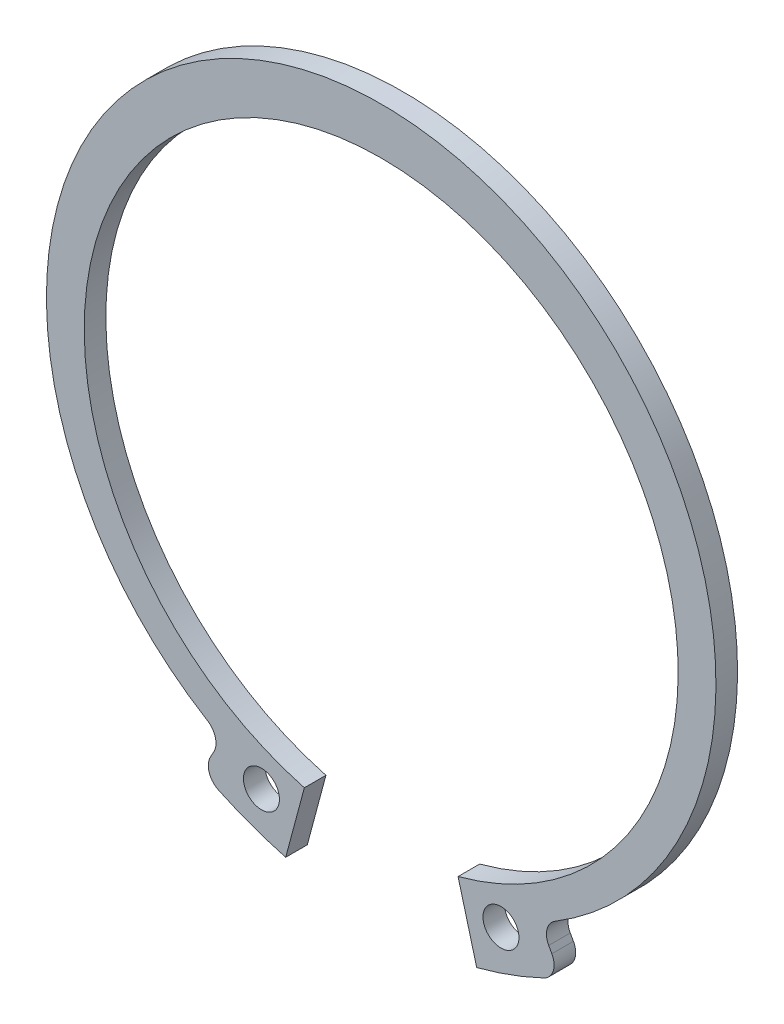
ISO-10303-21;
HEADER;
FILE_DESCRIPTION(('STEP AP214'),'2;1');
FILE_NAME('part.step','',(''),(''),'','','');
FILE_SCHEMA(('AUTOMOTIVE_DESIGN { 1 0 10303 214 1 1 1 1 }'));
ENDSEC;
DATA;
#1=APPLICATION_CONTEXT('core data for automotive mechanical design processes');
#2=APPLICATION_PROTOCOL_DEFINITION('international standard','automotive_design',2000,#1);
#3=PRODUCT_CONTEXT('',#1,'mechanical');
#4=PRODUCT('Part','Part','',(#3));
#5=PRODUCT_RELATED_PRODUCT_CATEGORY('part','',(#4));
#6=PRODUCT_DEFINITION_FORMATION('','',#4);
#7=PRODUCT_DEFINITION_CONTEXT('part definition',#1,'design');
#8=PRODUCT_DEFINITION('design','',#6,#7);
#9=PRODUCT_DEFINITION_SHAPE('','',#8);
#10=(LENGTH_UNIT() NAMED_UNIT(*) SI_UNIT(.MILLI.,.METRE.));
#11=(NAMED_UNIT(*) PLANE_ANGLE_UNIT() SI_UNIT($,.RADIAN.));
#12=(NAMED_UNIT(*) SI_UNIT($,.STERADIAN.) SOLID_ANGLE_UNIT());
#13=UNCERTAINTY_MEASURE_WITH_UNIT(LENGTH_MEASURE(1.E-05),#10,'distance_accuracy_value','');
#14=(GEOMETRIC_REPRESENTATION_CONTEXT(3) GLOBAL_UNCERTAINTY_ASSIGNED_CONTEXT((#13)) GLOBAL_UNIT_ASSIGNED_CONTEXT((#10,
#11,#12)) REPRESENTATION_CONTEXT('',''));
#15=CARTESIAN_POINT('',(0.,0.,0.));
#16=DIRECTION('',(0.,0.,1.));
#17=DIRECTION('',(1.,0.,0.));
#18=AXIS2_PLACEMENT_3D('',#15,#16,#17);
#19=CARTESIAN_POINT('',(-10.1795082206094,-16.2492570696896,1.2));
#20=DIRECTION('',(0.,0.,-1.));
#21=DIRECTION('',(-1.,0.,0.));
#22=AXIS2_PLACEMENT_3D('',#19,#20,#21);
#23=PLANE('',#22);
#24=CARTESIAN_POINT('',(6.6536710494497,-17.1877478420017,1.2));
#25=DIRECTION('',(0.,0.,1.));
#26=DIRECTION('',(1.,0.,0.));
#27=AXIS2_PLACEMENT_3D('',#24,#25,#26);
#28=CIRCLE('',#27,1.);
#29=CARTESIAN_POINT('',(7.6536710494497,-17.1877478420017,1.2));
#30=VERTEX_POINT('',#29);
#31=EDGE_CURVE('E137',#30,#30,#28,.T.);
#32=ORIENTED_EDGE('',*,*,#31,.F.);
#33=EDGE_LOOP('',(#32));
#34=FACE_BOUND('',#33,.T.);
#35=CARTESIAN_POINT('',(-10.1795082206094,-16.2492570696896,1.2));
#36=DIRECTION('',(0.,0.,-1.));
#37=DIRECTION('',(-1.,0.,0.));
#38=AXIS2_PLACEMENT_3D('',#35,#36,#37);
#39=CIRCLE('',#38,1.);
#40=CARTESIAN_POINT('',(-9.66014555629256,-15.3947031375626,1.2));
#41=VERTEX_POINT('',#40);
#42=CARTESIAN_POINT('',(-9.3055324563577,-16.7352265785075,1.2));
#43=VERTEX_POINT('',#42);
#44=EDGE_CURVE('E163',#41,#43,#39,.T.);
#45=ORIENTED_EDGE('',*,*,#44,.T.);
#46=DIRECTION('',(-0.485969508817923,-0.873975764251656,0.));
#47=VECTOR('',#46,1.);
#48=CARTESIAN_POINT('',(-9.3055324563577,-16.7352265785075,1.2));
#49=LINE('',#48,#47);
#50=CARTESIAN_POINT('',(-9.48013727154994,-17.0492388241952,1.2));
#51=VERTEX_POINT('',#50);
#52=EDGE_CURVE('E132',#43,#51,#49,.T.);
#53=ORIENTED_EDGE('',*,*,#52,.T.);
#54=CARTESIAN_POINT('',(-8.60616150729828,-17.5352083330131,1.2));
#55=DIRECTION('',(0.,0.,1.));
#56=DIRECTION('',(-1.,0.,0.));
#57=AXIS2_PLACEMENT_3D('',#54,#55,#56);
#58=CIRCLE('',#57,0.999999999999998);
#59=CARTESIAN_POINT('',(-9.03682785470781,-18.4377195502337,1.2));
#60=VERTEX_POINT('',#59);
#61=EDGE_CURVE('E166',#51,#60,#58,.T.);
#62=ORIENTED_EDGE('',*,*,#61,.T.);
#63=CARTESIAN_POINT('',(0.,0.5,1.2));
#64=DIRECTION('',(0.,0.,1.));
#65=DIRECTION('',(1.,0.,0.));
#66=AXIS2_PLACEMENT_3D('',#63,#64,#65);
#67=CIRCLE('',#66,20.9833619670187);
#68=CARTESIAN_POINT('',(-5.30579042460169,-19.8014794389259,1.2));
#69=VERTEX_POINT('',#68);
#70=EDGE_CURVE('E168',#60,#69,#67,.T.);
#71=ORIENTED_EDGE('',*,*,#70,.T.);
#72=DIRECTION('',(0.258819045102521,0.965925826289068,0.));
#73=VECTOR('',#72,1.);
#74=CARTESIAN_POINT('',(-4.2705142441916,-15.9377761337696,1.2));
#75=LINE('',#74,#73);
#76=CARTESIAN_POINT('',(-4.27051424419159,-15.9377761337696,1.2));
#77=VERTEX_POINT('',#76);
#78=EDGE_CURVE('E170',#69,#77,#75,.T.);
#79=ORIENTED_EDGE('',*,*,#78,.T.);
#80=CARTESIAN_POINT('',(0.,0.,1.2));
#81=DIRECTION('',(0.,0.,-1.));
#82=DIRECTION('',(1.,0.,0.));
#83=AXIS2_PLACEMENT_3D('',#80,#81,#82);
#84=CIRCLE('',#83,16.5);
#85=CARTESIAN_POINT('',(4.2705142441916,-15.9377761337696,1.2));
#86=VERTEX_POINT('',#85);
#87=EDGE_CURVE('E172',#77,#86,#84,.T.);
#88=ORIENTED_EDGE('',*,*,#87,.T.);
#89=DIRECTION('',(0.258819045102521,-0.965925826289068,0.));
#90=VECTOR('',#89,1.);
#91=CARTESIAN_POINT('',(4.2705142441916,-15.9377761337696,1.2));
#92=LINE('',#91,#90);
#93=CARTESIAN_POINT('',(5.30579042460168,-19.8014794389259,1.2));
#94=VERTEX_POINT('',#93);
#95=EDGE_CURVE('E174',#86,#94,#92,.T.);
#96=ORIENTED_EDGE('',*,*,#95,.T.);
#97=CARTESIAN_POINT('',(0.,0.5,1.2));
#98=DIRECTION('',(0.,0.,1.));
#99=DIRECTION('',(1.,0.,0.));
#100=AXIS2_PLACEMENT_3D('',#97,#98,#99);
#101=CIRCLE('',#100,20.9833619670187);
#102=CARTESIAN_POINT('',(9.0368278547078,-18.4377195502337,1.2));
#103=VERTEX_POINT('',#102);
#104=EDGE_CURVE('E176',#94,#103,#101,.T.);
#105=ORIENTED_EDGE('',*,*,#104,.T.);
#106=CARTESIAN_POINT('',(8.60616150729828,-17.5352083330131,1.2));
#107=DIRECTION('',(0.,0.,1.));
#108=DIRECTION('',(1.,0.,0.));
#109=AXIS2_PLACEMENT_3D('',#106,#107,#108);
#110=CIRCLE('',#109,0.999999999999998);
#111=CARTESIAN_POINT('',(9.48013727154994,-17.0492388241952,1.2));
#112=VERTEX_POINT('',#111);
#113=EDGE_CURVE('E178',#103,#112,#110,.T.);
#114=ORIENTED_EDGE('',*,*,#113,.T.);
#115=DIRECTION('',(-0.485969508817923,0.873975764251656,0.));
#116=VECTOR('',#115,1.);
#117=CARTESIAN_POINT('',(9.3055324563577,-16.7352265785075,1.2));
#118=LINE('',#117,#116);
#119=CARTESIAN_POINT('',(9.30553245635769,-16.7352265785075,1.2));
#120=VERTEX_POINT('',#119);
#121=EDGE_CURVE('E180',#112,#120,#118,.T.);
#122=ORIENTED_EDGE('',*,*,#121,.T.);
#123=CARTESIAN_POINT('',(10.1795082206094,-16.2492570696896,1.2));
#124=DIRECTION('',(0.,0.,-1.));
#125=DIRECTION('',(1.,0.,0.));
#126=AXIS2_PLACEMENT_3D('',#123,#124,#125);
#127=CIRCLE('',#126,1.);
#128=CARTESIAN_POINT('',(9.66014555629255,-15.3947031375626,1.2));
#129=VERTEX_POINT('',#128);
#130=EDGE_CURVE('E49',#120,#129,#127,.T.);
#131=ORIENTED_EDGE('',*,*,#130,.T.);
#132=CARTESIAN_POINT('',(0.,0.5,1.2));
#133=DIRECTION('',(0.,0.,1.));
#134=DIRECTION('',(1.,0.,0.));
#135=AXIS2_PLACEMENT_3D('',#132,#133,#134);
#136=CIRCLE('',#135,18.6);
#137=EDGE_CURVE('E44',#129,#41,#136,.T.);
#138=ORIENTED_EDGE('',*,*,#137,.T.);
#139=EDGE_LOOP('',(#45,#53,#62,#71,#79,#88,#96,#105,#114,#122,#131,#138));
#140=FACE_BOUND('',#139,.T.);
#141=CARTESIAN_POINT('',(-6.6536710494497,-17.1877478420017,1.2));
#142=DIRECTION('',(0.,0.,1.));
#143=DIRECTION('',(-1.,0.,0.));
#144=AXIS2_PLACEMENT_3D('',#141,#142,#143);
#145=CIRCLE('',#144,1.);
#146=CARTESIAN_POINT('',(-7.6536710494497,-17.1877478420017,1.2));
#147=VERTEX_POINT('',#146);
#148=EDGE_CURVE('E283',#147,#147,#145,.T.);
#149=ORIENTED_EDGE('',*,*,#148,.F.);
#150=EDGE_LOOP('',(#149));
#151=FACE_BOUND('',#150,.T.);
#152=ADVANCED_FACE('F29',(#34,#140,#151),#23,.F.);
#153=CARTESIAN_POINT('',(-10.1795082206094,-16.2492570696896,0.));
#154=DIRECTION('',(0.,0.,-1.));
#155=DIRECTION('',(-1.,0.,0.));
#156=AXIS2_PLACEMENT_3D('',#153,#154,#155);
#157=PLANE('',#156);
#158=CARTESIAN_POINT('',(6.6536710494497,-17.1877478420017,0.));
#159=DIRECTION('',(0.,0.,1.));
#160=DIRECTION('',(1.,0.,0.));
#161=AXIS2_PLACEMENT_3D('',#158,#159,#160);
#162=CIRCLE('',#161,1.);
#163=CARTESIAN_POINT('',(7.6536710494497,-17.1877478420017,0.));
#164=VERTEX_POINT('',#163);
#165=EDGE_CURVE('E140',#164,#164,#162,.T.);
#166=ORIENTED_EDGE('',*,*,#165,.T.);
#167=EDGE_LOOP('',(#166));
#168=FACE_BOUND('',#167,.T.);
#169=CARTESIAN_POINT('',(-10.1795082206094,-16.2492570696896,0.));
#170=DIRECTION('',(0.,0.,-1.));
#171=DIRECTION('',(-1.,0.,0.));
#172=AXIS2_PLACEMENT_3D('',#169,#170,#171);
#173=CIRCLE('',#172,1.);
#174=CARTESIAN_POINT('',(-9.66014555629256,-15.3947031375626,0.));
#175=VERTEX_POINT('',#174);
#176=CARTESIAN_POINT('',(-9.3055324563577,-16.7352265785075,0.));
#177=VERTEX_POINT('',#176);
#178=EDGE_CURVE('E123',#175,#177,#173,.T.);
#179=ORIENTED_EDGE('',*,*,#178,.F.);
#180=CARTESIAN_POINT('',(0.,0.5,0.));
#181=DIRECTION('',(0.,0.,1.));
#182=DIRECTION('',(1.,0.,0.));
#183=AXIS2_PLACEMENT_3D('',#180,#181,#182);
#184=CIRCLE('',#183,18.6);
#185=CARTESIAN_POINT('',(9.66014555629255,-15.3947031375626,0.));
#186=VERTEX_POINT('',#185);
#187=EDGE_CURVE('E161',#186,#175,#184,.T.);
#188=ORIENTED_EDGE('',*,*,#187,.F.);
#189=CARTESIAN_POINT('',(10.1795082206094,-16.2492570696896,0.));
#190=DIRECTION('',(0.,0.,-1.));
#191=DIRECTION('',(1.,0.,0.));
#192=AXIS2_PLACEMENT_3D('',#189,#190,#191);
#193=CIRCLE('',#192,1.);
#194=CARTESIAN_POINT('',(9.30553245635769,-16.7352265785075,0.));
#195=VERTEX_POINT('',#194);
#196=EDGE_CURVE('E159',#195,#186,#193,.T.);
#197=ORIENTED_EDGE('',*,*,#196,.F.);
#198=DIRECTION('',(-0.485969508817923,0.873975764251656,0.));
#199=VECTOR('',#198,1.);
#200=CARTESIAN_POINT('',(9.3055324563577,-16.7352265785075,0.));
#201=LINE('',#200,#199);
#202=CARTESIAN_POINT('',(9.48013727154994,-17.0492388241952,0.));
#203=VERTEX_POINT('',#202);
#204=EDGE_CURVE('E157',#203,#195,#201,.T.);
#205=ORIENTED_EDGE('',*,*,#204,.F.);
#206=CARTESIAN_POINT('',(8.60616150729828,-17.5352083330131,0.));
#207=DIRECTION('',(0.,0.,1.));
#208=DIRECTION('',(1.,0.,0.));
#209=AXIS2_PLACEMENT_3D('',#206,#207,#208);
#210=CIRCLE('',#209,0.999999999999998);
#211=CARTESIAN_POINT('',(9.0368278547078,-18.4377195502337,0.));
#212=VERTEX_POINT('',#211);
#213=EDGE_CURVE('E155',#212,#203,#210,.T.);
#214=ORIENTED_EDGE('',*,*,#213,.F.);
#215=CARTESIAN_POINT('',(0.,0.5,0.));
#216=DIRECTION('',(0.,0.,1.));
#217=DIRECTION('',(1.,0.,0.));
#218=AXIS2_PLACEMENT_3D('',#215,#216,#217);
#219=CIRCLE('',#218,20.9833619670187);
#220=CARTESIAN_POINT('',(5.30579042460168,-19.8014794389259,0.));
#221=VERTEX_POINT('',#220);
#222=EDGE_CURVE('E153',#221,#212,#219,.T.);
#223=ORIENTED_EDGE('',*,*,#222,.F.);
#224=DIRECTION('',(0.258819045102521,-0.965925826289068,0.));
#225=VECTOR('',#224,1.);
#226=CARTESIAN_POINT('',(4.2705142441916,-15.9377761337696,0.));
#227=LINE('',#226,#225);
#228=CARTESIAN_POINT('',(4.2705142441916,-15.9377761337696,0.));
#229=VERTEX_POINT('',#228);
#230=EDGE_CURVE('E151',#229,#221,#227,.T.);
#231=ORIENTED_EDGE('',*,*,#230,.F.);
#232=CARTESIAN_POINT('',(0.,0.,0.));
#233=DIRECTION('',(0.,0.,-1.));
#234=DIRECTION('',(1.,0.,0.));
#235=AXIS2_PLACEMENT_3D('',#232,#233,#234);
#236=CIRCLE('',#235,16.5);
#237=CARTESIAN_POINT('',(-4.27051424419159,-15.9377761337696,0.));
#238=VERTEX_POINT('',#237);
#239=EDGE_CURVE('E149',#238,#229,#236,.T.);
#240=ORIENTED_EDGE('',*,*,#239,.F.);
#241=DIRECTION('',(0.258819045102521,0.965925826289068,0.));
#242=VECTOR('',#241,1.);
#243=CARTESIAN_POINT('',(-4.2705142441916,-15.9377761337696,0.));
#244=LINE('',#243,#242);
#245=CARTESIAN_POINT('',(-5.30579042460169,-19.8014794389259,0.));
#246=VERTEX_POINT('',#245);
#247=EDGE_CURVE('E147',#246,#238,#244,.T.);
#248=ORIENTED_EDGE('',*,*,#247,.F.);
#249=CARTESIAN_POINT('',(0.,0.5,0.));
#250=DIRECTION('',(0.,0.,1.));
#251=DIRECTION('',(1.,0.,0.));
#252=AXIS2_PLACEMENT_3D('',#249,#250,#251);
#253=CIRCLE('',#252,20.9833619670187);
#254=CARTESIAN_POINT('',(-9.03682785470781,-18.4377195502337,0.));
#255=VERTEX_POINT('',#254);
#256=EDGE_CURVE('E145',#255,#246,#253,.T.);
#257=ORIENTED_EDGE('',*,*,#256,.F.);
#258=CARTESIAN_POINT('',(-8.60616150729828,-17.5352083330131,0.));
#259=DIRECTION('',(0.,0.,1.));
#260=DIRECTION('',(-1.,0.,0.));
#261=AXIS2_PLACEMENT_3D('',#258,#259,#260);
#262=CIRCLE('',#261,0.999999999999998);
#263=CARTESIAN_POINT('',(-9.48013727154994,-17.0492388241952,0.));
#264=VERTEX_POINT('',#263);
#265=EDGE_CURVE('E125',#264,#255,#262,.T.);
#266=ORIENTED_EDGE('',*,*,#265,.F.);
#267=DIRECTION('',(-0.485969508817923,-0.873975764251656,0.));
#268=VECTOR('',#267,1.);
#269=CARTESIAN_POINT('',(-9.3055324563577,-16.7352265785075,0.));
#270=LINE('',#269,#268);
#271=EDGE_CURVE('E118',#177,#264,#270,.T.);
#272=ORIENTED_EDGE('',*,*,#271,.F.);
#273=EDGE_LOOP('',(#179,#188,#197,#205,#214,#223,#231,#240,#248,#257,#266,#272));
#274=FACE_BOUND('',#273,.T.);
#275=CARTESIAN_POINT('',(-6.6536710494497,-17.1877478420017,0.));
#276=DIRECTION('',(0.,0.,1.));
#277=DIRECTION('',(-1.,0.,0.));
#278=AXIS2_PLACEMENT_3D('',#275,#276,#277);
#279=CIRCLE('',#278,1.);
#280=CARTESIAN_POINT('',(-7.6536710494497,-17.1877478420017,0.));
#281=VERTEX_POINT('',#280);
#282=EDGE_CURVE('E286',#281,#281,#279,.T.);
#283=ORIENTED_EDGE('',*,*,#282,.T.);
#284=EDGE_LOOP('',(#283));
#285=FACE_BOUND('',#284,.T.);
#286=ADVANCED_FACE('F119',(#168,#274,#285),#157,.T.);
#287=CARTESIAN_POINT('',(-10.1795082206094,-16.2492570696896,1.2));
#288=DIRECTION('',(0.,0.,-1.));
#289=DIRECTION('',(-1.,0.,0.));
#290=AXIS2_PLACEMENT_3D('',#287,#288,#289);
#291=CYLINDRICAL_SURFACE('',#290,1.);
#292=ORIENTED_EDGE('',*,*,#178,.T.);
#293=DIRECTION('',(0.,0.,-1.));
#294=VECTOR('',#293,1.);
#295=CARTESIAN_POINT('',(-9.3055324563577,-16.7352265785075,1.2));
#296=LINE('',#295,#294);
#297=EDGE_CURVE('E11',#43,#177,#296,.T.);
#298=ORIENTED_EDGE('',*,*,#297,.F.);
#299=ORIENTED_EDGE('',*,*,#44,.F.);
#300=DIRECTION('',(0.,0.,-1.));
#301=VECTOR('',#300,1.);
#302=CARTESIAN_POINT('',(-9.66014555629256,-15.3947031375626,1.2));
#303=LINE('',#302,#301);
#304=EDGE_CURVE('E136',#41,#175,#303,.T.);
#305=ORIENTED_EDGE('',*,*,#304,.T.);
#306=EDGE_LOOP('',(#292,#298,#299,#305));
#307=FACE_BOUND('',#306,.T.);
#308=ADVANCED_FACE('F31',(#307),#291,.F.);
#309=CARTESIAN_POINT('',(-9.3055324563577,-16.7352265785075,1.2));
#310=DIRECTION('',(0.873975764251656,-0.485969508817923,0.));
#311=DIRECTION('',(0.485969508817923,0.873975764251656,0.));
#312=AXIS2_PLACEMENT_3D('',#309,#310,#311);
#313=PLANE('',#312);
#314=ORIENTED_EDGE('',*,*,#271,.T.);
#315=DIRECTION('',(0.,0.,-1.));
#316=VECTOR('',#315,1.);
#317=CARTESIAN_POINT('',(-9.48013727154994,-17.0492388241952,1.2));
#318=LINE('',#317,#316);
#319=EDGE_CURVE('E37',#51,#264,#318,.T.);
#320=ORIENTED_EDGE('',*,*,#319,.F.);
#321=ORIENTED_EDGE('',*,*,#52,.F.);
#322=ORIENTED_EDGE('',*,*,#297,.T.);
#323=EDGE_LOOP('',(#314,#320,#321,#322));
#324=FACE_BOUND('',#323,.T.);
#325=ADVANCED_FACE('F131',(#324),#313,.F.);
#326=CARTESIAN_POINT('',(-8.60616150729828,-17.5352083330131,1.2));
#327=DIRECTION('',(0.,0.,-1.));
#328=DIRECTION('',(-1.,0.,0.));
#329=AXIS2_PLACEMENT_3D('',#326,#327,#328);
#330=CYLINDRICAL_SURFACE('',#329,0.999999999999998);
#331=ORIENTED_EDGE('',*,*,#265,.T.);
#332=DIRECTION('',(0.,0.,-1.));
#333=VECTOR('',#332,1.);
#334=CARTESIAN_POINT('',(-9.03682785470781,-18.4377195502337,1.2));
#335=LINE('',#334,#333);
#336=EDGE_CURVE('E209',#60,#255,#335,.T.);
#337=ORIENTED_EDGE('',*,*,#336,.F.);
#338=ORIENTED_EDGE('',*,*,#61,.F.);
#339=ORIENTED_EDGE('',*,*,#319,.T.);
#340=EDGE_LOOP('',(#331,#337,#338,#339));
#341=FACE_BOUND('',#340,.T.);
#342=ADVANCED_FACE('F213',(#341),#330,.T.);
#343=CARTESIAN_POINT('',(0.,0.5,1.2));
#344=DIRECTION('',(0.,0.,-1.));
#345=DIRECTION('',(-1.,0.,0.));
#346=AXIS2_PLACEMENT_3D('',#343,#344,#345);
#347=CYLINDRICAL_SURFACE('',#346,20.9833619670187);
#348=ORIENTED_EDGE('',*,*,#256,.T.);
#349=DIRECTION('',(0.,0.,-1.));
#350=VECTOR('',#349,1.);
#351=CARTESIAN_POINT('',(-5.30579042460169,-19.8014794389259,1.2));
#352=LINE('',#351,#350);
#353=EDGE_CURVE('E206',#69,#246,#352,.T.);
#354=ORIENTED_EDGE('',*,*,#353,.F.);
#355=ORIENTED_EDGE('',*,*,#70,.F.);
#356=ORIENTED_EDGE('',*,*,#336,.T.);
#357=EDGE_LOOP('',(#348,#354,#355,#356));
#358=FACE_BOUND('',#357,.T.);
#359=ADVANCED_FACE('F221',(#358),#347,.T.);
#360=CARTESIAN_POINT('',(-4.2705142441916,-15.9377761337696,1.2));
#361=DIRECTION('',(-0.965925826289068,0.258819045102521,0.));
#362=DIRECTION('',(-0.258819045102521,-0.965925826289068,0.));
#363=AXIS2_PLACEMENT_3D('',#360,#361,#362);
#364=PLANE('',#363);
#365=ORIENTED_EDGE('',*,*,#247,.T.);
#366=DIRECTION('',(0.,0.,-1.));
#367=VECTOR('',#366,1.);
#368=CARTESIAN_POINT('',(-4.27051424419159,-15.9377761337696,1.2));
#369=LINE('',#368,#367);
#370=EDGE_CURVE('E203',#77,#238,#369,.T.);
#371=ORIENTED_EDGE('',*,*,#370,.F.);
#372=ORIENTED_EDGE('',*,*,#78,.F.);
#373=ORIENTED_EDGE('',*,*,#353,.T.);
#374=EDGE_LOOP('',(#365,#371,#372,#373));
#375=FACE_BOUND('',#374,.T.);
#376=ADVANCED_FACE('F224',(#375),#364,.F.);
#377=CARTESIAN_POINT('',(0.,0.,1.2));
#378=DIRECTION('',(0.,0.,-1.));
#379=DIRECTION('',(-1.,0.,0.));
#380=AXIS2_PLACEMENT_3D('',#377,#378,#379);
#381=CYLINDRICAL_SURFACE('',#380,16.5);
#382=ORIENTED_EDGE('',*,*,#239,.T.);
#383=DIRECTION('',(0.,0.,-1.));
#384=VECTOR('',#383,1.);
#385=CARTESIAN_POINT('',(4.2705142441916,-15.9377761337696,1.2));
#386=LINE('',#385,#384);
#387=EDGE_CURVE('E200',#86,#229,#386,.T.);
#388=ORIENTED_EDGE('',*,*,#387,.F.);
#389=ORIENTED_EDGE('',*,*,#87,.F.);
#390=ORIENTED_EDGE('',*,*,#370,.T.);
#391=EDGE_LOOP('',(#382,#388,#389,#390));
#392=FACE_BOUND('',#391,.T.);
#393=ADVANCED_FACE('F229',(#392),#381,.F.);
#394=CARTESIAN_POINT('',(4.2705142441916,-15.9377761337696,1.2));
#395=DIRECTION('',(0.965925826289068,0.258819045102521,0.));
#396=DIRECTION('',(-0.258819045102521,0.965925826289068,0.));
#397=AXIS2_PLACEMENT_3D('',#394,#395,#396);
#398=PLANE('',#397);
#399=ORIENTED_EDGE('',*,*,#230,.T.);
#400=DIRECTION('',(0.,0.,-1.));
#401=VECTOR('',#400,1.);
#402=CARTESIAN_POINT('',(5.30579042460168,-19.8014794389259,1.2));
#403=LINE('',#402,#401);
#404=EDGE_CURVE('E197',#94,#221,#403,.T.);
#405=ORIENTED_EDGE('',*,*,#404,.F.);
#406=ORIENTED_EDGE('',*,*,#95,.F.);
#407=ORIENTED_EDGE('',*,*,#387,.T.);
#408=EDGE_LOOP('',(#399,#405,#406,#407));
#409=FACE_BOUND('',#408,.T.);
#410=ADVANCED_FACE('F235',(#409),#398,.F.);
#411=CARTESIAN_POINT('',(0.,0.5,1.2));
#412=DIRECTION('',(0.,0.,-1.));
#413=DIRECTION('',(-1.,0.,0.));
#414=AXIS2_PLACEMENT_3D('',#411,#412,#413);
#415=CYLINDRICAL_SURFACE('',#414,20.9833619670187);
#416=ORIENTED_EDGE('',*,*,#222,.T.);
#417=DIRECTION('',(0.,0.,-1.));
#418=VECTOR('',#417,1.);
#419=CARTESIAN_POINT('',(9.0368278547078,-18.4377195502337,1.2));
#420=LINE('',#419,#418);
#421=EDGE_CURVE('E194',#103,#212,#420,.T.);
#422=ORIENTED_EDGE('',*,*,#421,.F.);
#423=ORIENTED_EDGE('',*,*,#104,.F.);
#424=ORIENTED_EDGE('',*,*,#404,.T.);
#425=EDGE_LOOP('',(#416,#422,#423,#424));
#426=FACE_BOUND('',#425,.T.);
#427=ADVANCED_FACE('F239',(#426),#415,.T.);
#428=CARTESIAN_POINT('',(8.60616150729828,-17.5352083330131,1.2));
#429=DIRECTION('',(0.,0.,-1.));
#430=DIRECTION('',(-1.,0.,0.));
#431=AXIS2_PLACEMENT_3D('',#428,#429,#430);
#432=CYLINDRICAL_SURFACE('',#431,0.999999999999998);
#433=ORIENTED_EDGE('',*,*,#213,.T.);
#434=DIRECTION('',(0.,0.,-1.));
#435=VECTOR('',#434,1.);
#436=CARTESIAN_POINT('',(9.48013727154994,-17.0492388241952,1.2));
#437=LINE('',#436,#435);
#438=EDGE_CURVE('E191',#112,#203,#437,.T.);
#439=ORIENTED_EDGE('',*,*,#438,.F.);
#440=ORIENTED_EDGE('',*,*,#113,.F.);
#441=ORIENTED_EDGE('',*,*,#421,.T.);
#442=EDGE_LOOP('',(#433,#439,#440,#441));
#443=FACE_BOUND('',#442,.T.);
#444=ADVANCED_FACE('F244',(#443),#432,.T.);
#445=CARTESIAN_POINT('',(9.3055324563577,-16.7352265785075,1.2));
#446=DIRECTION('',(-0.873975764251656,-0.485969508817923,0.));
#447=DIRECTION('',(0.485969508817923,-0.873975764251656,0.));
#448=AXIS2_PLACEMENT_3D('',#445,#446,#447);
#449=PLANE('',#448);
#450=ORIENTED_EDGE('',*,*,#204,.T.);
#451=DIRECTION('',(0.,0.,-1.));
#452=VECTOR('',#451,1.);
#453=CARTESIAN_POINT('',(9.30553245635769,-16.7352265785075,1.2));
#454=LINE('',#453,#452);
#455=EDGE_CURVE('E188',#120,#195,#454,.T.);
#456=ORIENTED_EDGE('',*,*,#455,.F.);
#457=ORIENTED_EDGE('',*,*,#121,.F.);
#458=ORIENTED_EDGE('',*,*,#438,.T.);
#459=EDGE_LOOP('',(#450,#456,#457,#458));
#460=FACE_BOUND('',#459,.T.);
#461=ADVANCED_FACE('F248',(#460),#449,.F.);
#462=CARTESIAN_POINT('',(10.1795082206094,-16.2492570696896,1.2));
#463=DIRECTION('',(0.,0.,-1.));
#464=DIRECTION('',(-1.,0.,0.));
#465=AXIS2_PLACEMENT_3D('',#462,#463,#464);
#466=CYLINDRICAL_SURFACE('',#465,1.);
#467=ORIENTED_EDGE('',*,*,#196,.T.);
#468=DIRECTION('',(0.,0.,-1.));
#469=VECTOR('',#468,1.);
#470=CARTESIAN_POINT('',(9.66014555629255,-15.3947031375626,1.2));
#471=LINE('',#470,#469);
#472=EDGE_CURVE('E185',#129,#186,#471,.T.);
#473=ORIENTED_EDGE('',*,*,#472,.F.);
#474=ORIENTED_EDGE('',*,*,#130,.F.);
#475=ORIENTED_EDGE('',*,*,#455,.T.);
#476=EDGE_LOOP('',(#467,#473,#474,#475));
#477=FACE_BOUND('',#476,.T.);
#478=ADVANCED_FACE('F252',(#477),#466,.F.);
#479=CARTESIAN_POINT('',(0.,0.5,1.2));
#480=DIRECTION('',(0.,0.,-1.));
#481=DIRECTION('',(-1.,0.,0.));
#482=AXIS2_PLACEMENT_3D('',#479,#480,#481);
#483=CYLINDRICAL_SURFACE('',#482,18.6);
#484=ORIENTED_EDGE('',*,*,#187,.T.);
#485=ORIENTED_EDGE('',*,*,#304,.F.);
#486=ORIENTED_EDGE('',*,*,#137,.F.);
#487=ORIENTED_EDGE('',*,*,#472,.T.);
#488=EDGE_LOOP('',(#484,#485,#486,#487));
#489=FACE_BOUND('',#488,.T.);
#490=ADVANCED_FACE('F254',(#489),#483,.T.);
#491=CARTESIAN_POINT('',(6.6536710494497,-17.1877478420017,1.2));
#492=DIRECTION('',(0.,0.,-1.));
#493=DIRECTION('',(-1.,0.,0.));
#494=AXIS2_PLACEMENT_3D('',#491,#492,#493);
#495=CYLINDRICAL_SURFACE('',#494,1.);
#496=ORIENTED_EDGE('',*,*,#31,.T.);
#497=EDGE_LOOP('',(#496));
#498=FACE_BOUND('',#497,.T.);
#499=ORIENTED_EDGE('',*,*,#165,.F.);
#500=EDGE_LOOP('',(#499));
#501=FACE_BOUND('',#500,.T.);
#502=ADVANCED_FACE('F256',(#498,#501),#495,.F.);
#503=CARTESIAN_POINT('',(-6.6536710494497,-17.1877478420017,1.2));
#504=DIRECTION('',(0.,0.,-1.));
#505=DIRECTION('',(-1.,0.,0.));
#506=AXIS2_PLACEMENT_3D('',#503,#504,#505);
#507=CYLINDRICAL_SURFACE('',#506,1.);
#508=ORIENTED_EDGE('',*,*,#148,.T.);
#509=EDGE_LOOP('',(#508));
#510=FACE_BOUND('',#509,.T.);
#511=ORIENTED_EDGE('',*,*,#282,.F.);
#512=EDGE_LOOP('',(#511));
#513=FACE_BOUND('',#512,.T.);
#514=ADVANCED_FACE('F262',(#510,#513),#507,.F.);
#515=CLOSED_SHELL('',(#152,#286,#308,#325,#342,#359,#376,#393,#410,#427,#444,#461,#478,#490,
#502,#514));
#516=MANIFOLD_SOLID_BREP('B2',#515);
#517=ADVANCED_BREP_SHAPE_REPRESENTATION('',(#18,#516),#14);
#518=SHAPE_DEFINITION_REPRESENTATION(#9,#517);
ENDSEC;
END-ISO-10303-21;
